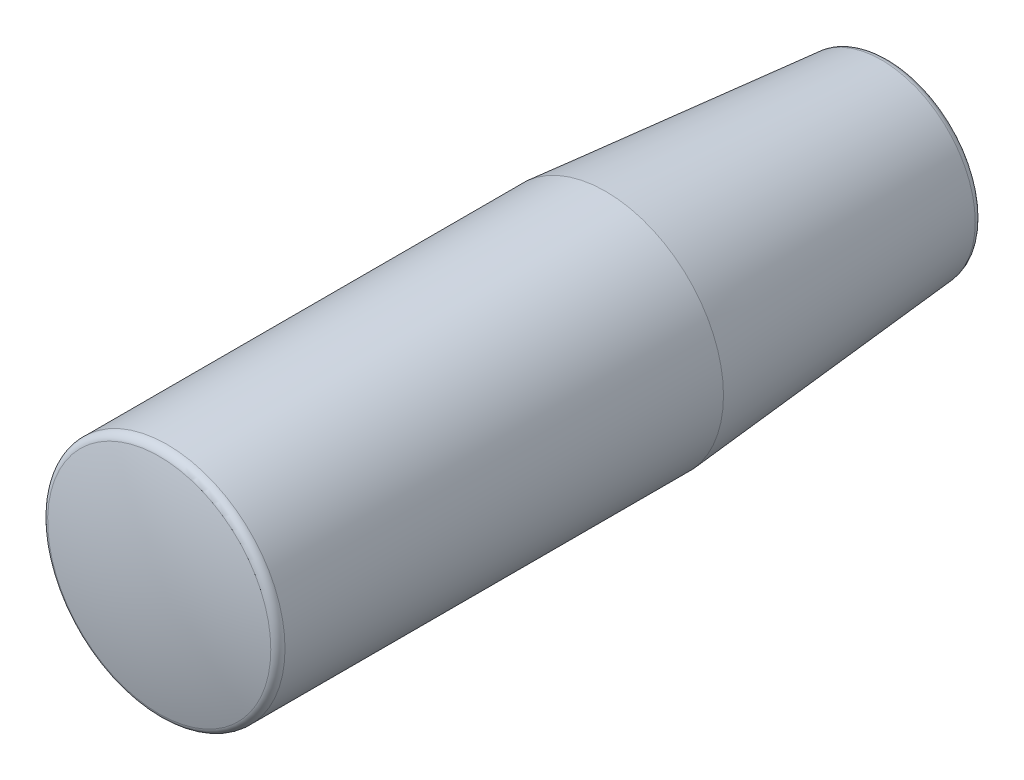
ISO-10303-21;
HEADER;
FILE_DESCRIPTION(('STEP AP214'),'2;1');
FILE_NAME('part.step','',(''),(''),'','','');
FILE_SCHEMA(('AUTOMOTIVE_DESIGN { 1 0 10303 214 1 1 1 1 }'));
ENDSEC;
DATA;
#1=APPLICATION_CONTEXT('core data for automotive mechanical design processes');
#2=APPLICATION_PROTOCOL_DEFINITION('international standard','automotive_design',2000,#1);
#3=PRODUCT_CONTEXT('',#1,'mechanical');
#4=PRODUCT('Part','Part','',(#3));
#5=PRODUCT_RELATED_PRODUCT_CATEGORY('part','',(#4));
#6=PRODUCT_DEFINITION_FORMATION('','',#4);
#7=PRODUCT_DEFINITION_CONTEXT('part definition',#1,'design');
#8=PRODUCT_DEFINITION('design','',#6,#7);
#9=PRODUCT_DEFINITION_SHAPE('','',#8);
#10=(LENGTH_UNIT() NAMED_UNIT(*) SI_UNIT(.MILLI.,.METRE.));
#11=(NAMED_UNIT(*) PLANE_ANGLE_UNIT() SI_UNIT($,.RADIAN.));
#12=(NAMED_UNIT(*) SI_UNIT($,.STERADIAN.) SOLID_ANGLE_UNIT());
#13=UNCERTAINTY_MEASURE_WITH_UNIT(LENGTH_MEASURE(1.E-05),#10,'distance_accuracy_value','');
#14=(GEOMETRIC_REPRESENTATION_CONTEXT(3) GLOBAL_UNCERTAINTY_ASSIGNED_CONTEXT((#13)) GLOBAL_UNIT_ASSIGNED_CONTEXT((#10,
#11,#12)) REPRESENTATION_CONTEXT('',''));
#15=CARTESIAN_POINT('',(0.,0.,0.));
#16=DIRECTION('',(0.,0.,1.));
#17=DIRECTION('',(1.,0.,0.));
#18=AXIS2_PLACEMENT_3D('',#15,#16,#17);
#19=CARTESIAN_POINT('',(0.,0.,0.));
#20=DIRECTION('',(0.,0.,1.));
#21=DIRECTION('',(1.,0.,0.));
#22=AXIS2_PLACEMENT_3D('',#19,#20,#21);
#23=PLANE('',#22);
#24=CARTESIAN_POINT('',(0.,0.,0.));
#25=DIRECTION('',(0.,0.,1.));
#26=DIRECTION('',(1.,0.,0.));
#27=AXIS2_PLACEMENT_3D('',#24,#25,#26);
#28=CIRCLE('',#27,10.3336688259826);
#29=CARTESIAN_POINT('',(10.3336688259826,0.,0.));
#30=VERTEX_POINT('',#29);
#31=EDGE_CURVE('E8',#30,#30,#28,.T.);
#32=ORIENTED_EDGE('',*,*,#31,.F.);
#33=EDGE_LOOP('',(#32));
#34=FACE_BOUND('',#33,.T.);
#35=CARTESIAN_POINT('',(0.,0.,0.));
#36=DIRECTION('',(0.,0.,1.));
#37=DIRECTION('',(1.,0.,0.));
#38=AXIS2_PLACEMENT_3D('',#35,#36,#37);
#39=CIRCLE('',#38,6.6);
#40=CARTESIAN_POINT('',(6.6,0.,0.));
#41=VERTEX_POINT('',#40);
#42=EDGE_CURVE('E34',#41,#41,#39,.T.);
#43=ORIENTED_EDGE('',*,*,#42,.T.);
#44=EDGE_LOOP('',(#43));
#45=FACE_BOUND('',#44,.T.);
#46=ADVANCED_FACE('F12',(#34,#45),#23,.F.);
#47=CARTESIAN_POINT('',(0.,0.,1.));
#48=DIRECTION('',(0.,0.,1.));
#49=DIRECTION('',(1.,0.,0.));
#50=AXIS2_PLACEMENT_3D('',#47,#48,#49);
#51=TOROIDAL_SURFACE('',#50,10.3336688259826,1.);
#52=ORIENTED_EDGE('',*,*,#31,.T.);
#53=EDGE_LOOP('',(#52));
#54=FACE_BOUND('',#53,.T.);
#55=CARTESIAN_POINT('',(0.,0.,0.91284425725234));
#56=DIRECTION('',(0.,0.,1.));
#57=DIRECTION('',(1.,0.,0.));
#58=AXIS2_PLACEMENT_3D('',#55,#56,#57);
#59=CIRCLE('',#58,11.3298635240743);
#60=CARTESIAN_POINT('',(11.3298635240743,0.,0.91284425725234));
#61=VERTEX_POINT('',#60);
#62=EDGE_CURVE('E19',#61,#61,#59,.T.);
#63=ORIENTED_EDGE('',*,*,#62,.F.);
#64=EDGE_LOOP('',(#63));
#65=FACE_BOUND('',#64,.T.);
#66=ADVANCED_FACE('F72',(#54,#65),#51,.T.);
#67=CARTESIAN_POINT('',(0.,0.,0.91284425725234));
#68=DIRECTION('',(0.,0.,1.));
#69=DIRECTION('',(1.,0.,0.));
#70=AXIS2_PLACEMENT_3D('',#67,#68,#69);
#71=CONICAL_SURFACE('',#70,11.3298635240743,0.0872664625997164);
#72=CARTESIAN_POINT('',(0.,0.,34.290156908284));
#73=DIRECTION('',(0.,0.,1.));
#74=DIRECTION('',(1.,0.,0.));
#75=AXIS2_PLACEMENT_3D('',#72,#73,#74);
#76=CIRCLE('',#75,14.25);
#77=CARTESIAN_POINT('',(14.25,0.,34.290156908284));
#78=VERTEX_POINT('',#77);
#79=EDGE_CURVE('E23',#78,#78,#76,.T.);
#80=ORIENTED_EDGE('',*,*,#79,.F.);
#81=EDGE_LOOP('',(#80));
#82=FACE_BOUND('',#81,.T.);
#83=ORIENTED_EDGE('',*,*,#62,.T.);
#84=EDGE_LOOP('',(#83));
#85=FACE_BOUND('',#84,.T.);
#86=ADVANCED_FACE('F78',(#82,#85),#71,.T.);
#87=CARTESIAN_POINT('',(0.,0.,90.));
#88=DIRECTION('',(0.,0.,1.));
#89=DIRECTION('',(1.,0.,0.));
#90=AXIS2_PLACEMENT_3D('',#87,#88,#89);
#91=CYLINDRICAL_SURFACE('',#90,14.25);
#92=CARTESIAN_POINT('',(0.,0.,87.3296408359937));
#93=DIRECTION('',(0.,0.,1.));
#94=DIRECTION('',(1.,0.,0.));
#95=AXIS2_PLACEMENT_3D('',#92,#93,#94);
#96=CIRCLE('',#95,14.25);
#97=CARTESIAN_POINT('',(14.25,0.,87.3296408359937));
#98=VERTEX_POINT('',#97);
#99=EDGE_CURVE('E28',#98,#98,#96,.T.);
#100=ORIENTED_EDGE('',*,*,#99,.F.);
#101=EDGE_LOOP('',(#100));
#102=FACE_BOUND('',#101,.T.);
#103=ORIENTED_EDGE('',*,*,#79,.T.);
#104=EDGE_LOOP('',(#103));
#105=FACE_BOUND('',#104,.T.);
#106=ADVANCED_FACE('F101',(#102,#105),#91,.T.);
#107=CARTESIAN_POINT('',(0.,0.,87.3296408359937));
#108=DIRECTION('',(0.,0.,1.));
#109=DIRECTION('',(1.,0.,0.));
#110=AXIS2_PLACEMENT_3D('',#107,#108,#109);
#111=TOROIDAL_SURFACE('',#110,13.25,0.999999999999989);
#112=ORIENTED_EDGE('',*,*,#99,.T.);
#113=EDGE_LOOP('',(#112));
#114=FACE_BOUND('',#113,.T.);
#115=CARTESIAN_POINT('',(0.,0.,88.2983533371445));
#116=DIRECTION('',(0.,0.,1.));
#117=DIRECTION('',(1.,0.,0.));
#118=AXIS2_PLACEMENT_3D('',#115,#116,#117);
#119=CIRCLE('',#118,13.498185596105);
#120=CARTESIAN_POINT('',(13.498185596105,0.,88.2983533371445));
#121=VERTEX_POINT('',#120);
#122=EDGE_CURVE('E31',#121,#121,#119,.T.);
#123=ORIENTED_EDGE('',*,*,#122,.F.);
#124=EDGE_LOOP('',(#123));
#125=FACE_BOUND('',#124,.T.);
#126=ADVANCED_FACE('F94',(#114,#125),#111,.T.);
#127=CARTESIAN_POINT('',(0.,0.,35.6124999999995));
#128=DIRECTION('',(0.,0.,1.));
#129=DIRECTION('',(0.,-1.,0.));
#130=AXIS2_PLACEMENT_3D('',#127,#128,#129);
#131=SPHERICAL_SURFACE('',#130,54.3875);
#132=ORIENTED_EDGE('',*,*,#122,.T.);
#133=EDGE_LOOP('',(#132));
#134=FACE_BOUND('',#133,.T.);
#135=ADVANCED_FACE('F84',(#134),#131,.T.);
#136=CARTESIAN_POINT('',(0.,0.,69.6));
#137=DIRECTION('',(0.,0.,1.));
#138=DIRECTION('',(1.,0.,0.));
#139=AXIS2_PLACEMENT_3D('',#136,#137,#138);
#140=CYLINDRICAL_SURFACE('',#139,6.6);
#141=CARTESIAN_POINT('',(0.,0.,7.));
#142=DIRECTION('',(0.,0.,1.));
#143=DIRECTION('',(1.,0.,0.));
#144=AXIS2_PLACEMENT_3D('',#141,#142,#143);
#145=CIRCLE('',#144,6.6);
#146=CARTESIAN_POINT('',(6.6,0.,7.));
#147=VERTEX_POINT('',#146);
#148=EDGE_CURVE('E37',#147,#147,#145,.T.);
#149=ORIENTED_EDGE('',*,*,#148,.T.);
#150=EDGE_LOOP('',(#149));
#151=FACE_BOUND('',#150,.T.);
#152=ORIENTED_EDGE('',*,*,#42,.F.);
#153=EDGE_LOOP('',(#152));
#154=FACE_BOUND('',#153,.T.);
#155=ADVANCED_FACE('F82',(#151,#154),#140,.F.);
#156=CARTESIAN_POINT('',(0.,6.6,7.));
#157=DIRECTION('',(0.,0.,-1.));
#158=DIRECTION('',(-1.,0.,0.));
#159=AXIS2_PLACEMENT_3D('',#156,#157,#158);
#160=PLANE('',#159);
#161=CARTESIAN_POINT('',(0.,0.,7.));
#162=DIRECTION('',(0.,0.,-1.));
#163=DIRECTION('',(-1.,0.,0.));
#164=AXIS2_PLACEMENT_3D('',#161,#162,#163);
#165=CIRCLE('',#164,6.);
#166=CARTESIAN_POINT('',(-6.,0.,7.));
#167=VERTEX_POINT('',#166);
#168=EDGE_CURVE('E43',#167,#167,#165,.T.);
#169=ORIENTED_EDGE('',*,*,#168,.F.);
#170=EDGE_LOOP('',(#169));
#171=FACE_BOUND('',#170,.T.);
#172=ORIENTED_EDGE('',*,*,#148,.F.);
#173=EDGE_LOOP('',(#172));
#174=FACE_BOUND('',#173,.T.);
#175=ADVANCED_FACE('F68',(#171,#174),#160,.T.);
#176=CARTESIAN_POINT('',(0.,0.,58.));
#177=DIRECTION('',(0.,0.,-1.));
#178=DIRECTION('',(-1.,0.,0.));
#179=AXIS2_PLACEMENT_3D('',#176,#177,#178);
#180=CYLINDRICAL_SURFACE('',#179,6.);
#181=ORIENTED_EDGE('',*,*,#168,.T.);
#182=EDGE_LOOP('',(#181));
#183=FACE_BOUND('',#182,.T.);
#184=CARTESIAN_POINT('',(0.,0.,58.));
#185=DIRECTION('',(0.,0.,-1.));
#186=DIRECTION('',(-1.,0.,0.));
#187=AXIS2_PLACEMENT_3D('',#184,#185,#186);
#188=CIRCLE('',#187,6.);
#189=CARTESIAN_POINT('',(-6.,0.,58.));
#190=VERTEX_POINT('',#189);
#191=EDGE_CURVE('E46',#190,#190,#188,.T.);
#192=ORIENTED_EDGE('',*,*,#191,.F.);
#193=EDGE_LOOP('',(#192));
#194=FACE_BOUND('',#193,.T.);
#195=ADVANCED_FACE('F58',(#183,#194),#180,.F.);
#196=CARTESIAN_POINT('',(0.,0.,58.));
#197=DIRECTION('',(0.,0.,-1.));
#198=DIRECTION('',(-1.,0.,0.));
#199=AXIS2_PLACEMENT_3D('',#196,#197,#198);
#200=PLANE('',#199);
#201=CARTESIAN_POINT('',(0.,0.,58.));
#202=DIRECTION('',(0.,0.,-1.));
#203=DIRECTION('',(-1.,0.,0.));
#204=AXIS2_PLACEMENT_3D('',#201,#202,#203);
#205=CIRCLE('',#204,5.053);
#206=CARTESIAN_POINT('',(-5.053,0.,58.));
#207=VERTEX_POINT('',#206);
#208=EDGE_CURVE('E15',#207,#207,#205,.T.);
#209=ORIENTED_EDGE('',*,*,#208,.F.);
#210=EDGE_LOOP('',(#209));
#211=FACE_BOUND('',#210,.T.);
#212=ORIENTED_EDGE('',*,*,#191,.T.);
#213=EDGE_LOOP('',(#212));
#214=FACE_BOUND('',#213,.T.);
#215=ADVANCED_FACE('F55',(#211,#214),#200,.T.);
#216=CARTESIAN_POINT('',(0.,5.053,69.6));
#217=DIRECTION('',(0.,0.,-1.));
#218=DIRECTION('',(-1.,0.,0.));
#219=AXIS2_PLACEMENT_3D('',#216,#217,#218);
#220=PLANE('',#219);
#221=CARTESIAN_POINT('',(0.,0.,69.6));
#222=DIRECTION('',(0.,0.,1.));
#223=DIRECTION('',(1.,0.,0.));
#224=AXIS2_PLACEMENT_3D('',#221,#222,#223);
#225=CIRCLE('',#224,5.053);
#226=CARTESIAN_POINT('',(5.053,0.,69.6));
#227=VERTEX_POINT('',#226);
#228=EDGE_CURVE('E40',#227,#227,#225,.T.);
#229=ORIENTED_EDGE('',*,*,#228,.F.);
#230=EDGE_LOOP('',(#229));
#231=FACE_BOUND('',#230,.T.);
#232=ADVANCED_FACE('F57',(#231),#220,.T.);
#233=CARTESIAN_POINT('',(0.,0.,69.6));
#234=DIRECTION('',(0.,0.,1.));
#235=DIRECTION('',(1.,0.,0.));
#236=AXIS2_PLACEMENT_3D('',#233,#234,#235);
#237=CYLINDRICAL_SURFACE('',#236,5.053);
#238=ORIENTED_EDGE('',*,*,#228,.T.);
#239=EDGE_LOOP('',(#238));
#240=FACE_BOUND('',#239,.T.);
#241=ORIENTED_EDGE('',*,*,#208,.T.);
#242=EDGE_LOOP('',(#241));
#243=FACE_BOUND('',#242,.T.);
#244=ADVANCED_FACE('F53',(#240,#243),#237,.F.);
#245=CLOSED_SHELL('',(#46,#66,#86,#106,#126,#135,#155,#175,#195,#215,#232,#244));
#246=MANIFOLD_SOLID_BREP('B1',#245);
#247=ADVANCED_BREP_SHAPE_REPRESENTATION('',(#18,#246),#14);
#248=SHAPE_DEFINITION_REPRESENTATION(#9,#247);
ENDSEC;
END-ISO-10303-21;
